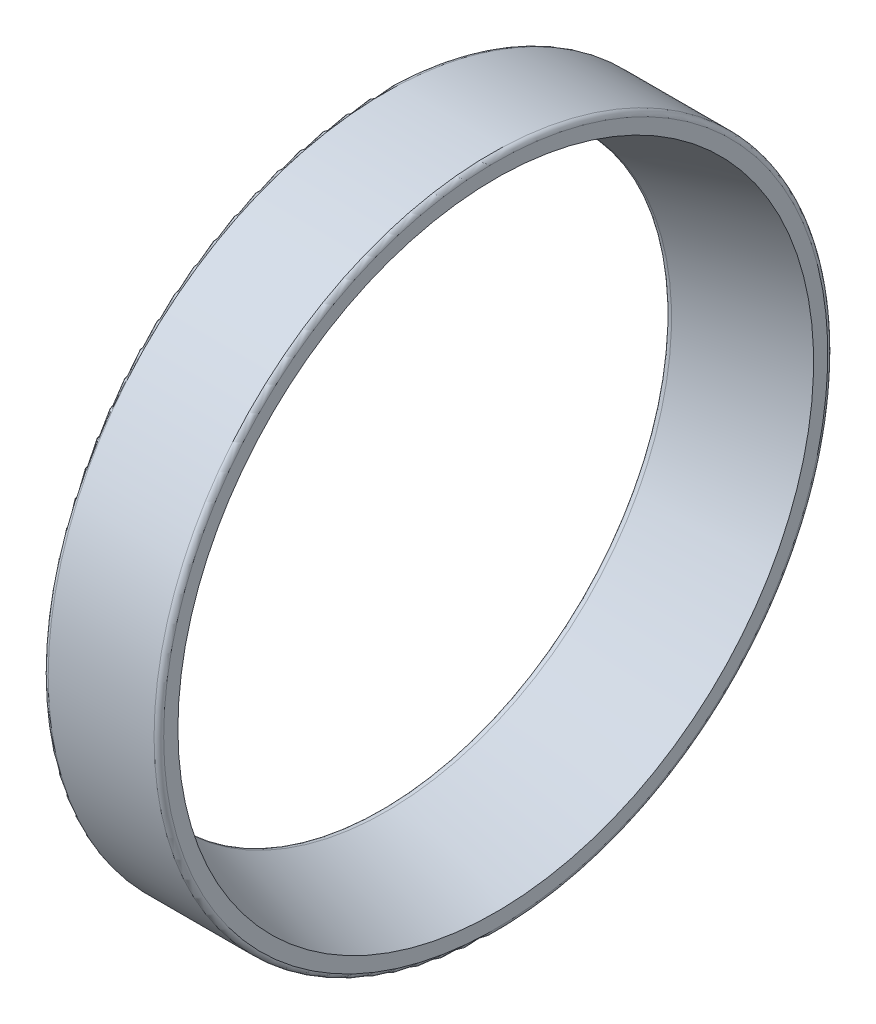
from build123d import *


with BuildPart() as part:
    # Esquisse1 → Base-R_volution (revolve)
    with BuildSketch(Plane(origin=(0, 0, 0), x_dir=(1, 0, 0), z_dir=(0, 1, 0)), mode=Mode.PRIVATE) as base_r_volution_sk:
        with BuildLine():
            Line((0, 60.197306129), (0, 69))
            ThreePointArc((0, 69), (0.292893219, 69.707106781), (1, 70))
            Line((1, 70), (23, 70))
            ThreePointArc((23, 70), (23.707106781, 69.707106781), (24, 69))
            Line((24, 69), (24, 66.046697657))
            Line((24, 66.046697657), (21.042910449, 65.16042719))
            Line((21.042910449, 65.16042719), (1.766044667, 59.382950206))
            Line((1.766044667, 59.382950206), (1.287093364, 59.239403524))
            ThreePointArc((1.287093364, 59.239403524), (0.402962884, 59.395092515), (0, 60.197306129))
        make_face()
    revolve(base_r_volution_sk.sketch.rotate(Axis((0, 0, 0), (1, 0, 0)), 180), axis=Axis((0, 0, 0), (1, 0, 0)))


solid = part.part
